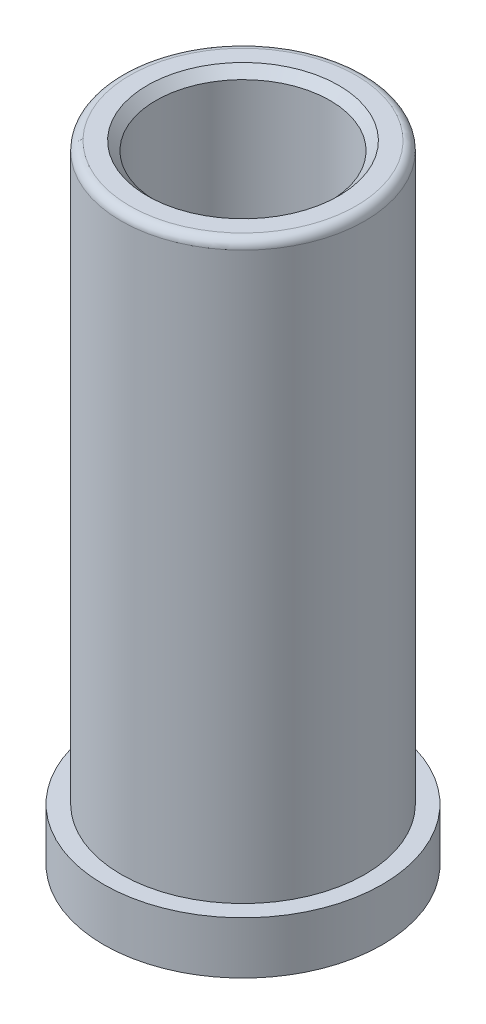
ISO-10303-21;
HEADER;
FILE_DESCRIPTION(('STEP AP214'),'2;1');
FILE_NAME('part.step','',(''),(''),'','','');
FILE_SCHEMA(('AUTOMOTIVE_DESIGN { 1 0 10303 214 1 1 1 1 }'));
ENDSEC;
DATA;
#1=APPLICATION_CONTEXT('core data for automotive mechanical design processes');
#2=APPLICATION_PROTOCOL_DEFINITION('international standard','automotive_design',2000,#1);
#3=PRODUCT_CONTEXT('',#1,'mechanical');
#4=PRODUCT('Part','Part','',(#3));
#5=PRODUCT_RELATED_PRODUCT_CATEGORY('part','',(#4));
#6=PRODUCT_DEFINITION_FORMATION('','',#4);
#7=PRODUCT_DEFINITION_CONTEXT('part definition',#1,'design');
#8=PRODUCT_DEFINITION('design','',#6,#7);
#9=PRODUCT_DEFINITION_SHAPE('','',#8);
#10=(LENGTH_UNIT() NAMED_UNIT(*) SI_UNIT(.MILLI.,.METRE.));
#11=(NAMED_UNIT(*) PLANE_ANGLE_UNIT() SI_UNIT($,.RADIAN.));
#12=(NAMED_UNIT(*) SI_UNIT($,.STERADIAN.) SOLID_ANGLE_UNIT());
#13=UNCERTAINTY_MEASURE_WITH_UNIT(LENGTH_MEASURE(1.E-05),#10,'distance_accuracy_value','');
#14=(GEOMETRIC_REPRESENTATION_CONTEXT(3) GLOBAL_UNCERTAINTY_ASSIGNED_CONTEXT((#13)) GLOBAL_UNIT_ASSIGNED_CONTEXT((#10,
#11,#12)) REPRESENTATION_CONTEXT('',''));
#15=CARTESIAN_POINT('',(0.,0.,0.));
#16=DIRECTION('',(0.,0.,1.));
#17=DIRECTION('',(1.,0.,0.));
#18=AXIS2_PLACEMENT_3D('',#15,#16,#17);
#19=CARTESIAN_POINT('',(0.,0.,0.));
#20=DIRECTION('',(0.,-1.,0.));
#21=DIRECTION('',(0.,0.,-1.));
#22=AXIS2_PLACEMENT_3D('',#19,#20,#21);
#23=CYLINDRICAL_SURFACE('',#22,7.);
#24=CARTESIAN_POINT('',(0.,32.5,0.));
#25=DIRECTION('',(0.,-1.,0.));
#26=DIRECTION('',(0.,0.,-1.));
#27=AXIS2_PLACEMENT_3D('',#24,#25,#26);
#28=CIRCLE('',#27,7.);
#29=CARTESIAN_POINT('',(0.,32.5,-7.));
#30=VERTEX_POINT('',#29);
#31=EDGE_CURVE('E21',#30,#30,#28,.T.);
#32=ORIENTED_EDGE('',*,*,#31,.T.);
#33=EDGE_LOOP('',(#32));
#34=FACE_BOUND('',#33,.T.);
#35=CARTESIAN_POINT('',(0.,0.,0.));
#36=DIRECTION('',(0.,-1.,0.));
#37=DIRECTION('',(0.,0.,-1.));
#38=AXIS2_PLACEMENT_3D('',#35,#36,#37);
#39=CIRCLE('',#38,7.);
#40=CARTESIAN_POINT('',(0.,0.,-7.));
#41=VERTEX_POINT('',#40);
#42=EDGE_CURVE('E49',#41,#41,#39,.T.);
#43=ORIENTED_EDGE('',*,*,#42,.F.);
#44=EDGE_LOOP('',(#43));
#45=FACE_BOUND('',#44,.T.);
#46=ADVANCED_FACE('F14',(#34,#45),#23,.T.);
#47=CARTESIAN_POINT('',(-7.,33.,0.));
#48=DIRECTION('',(0.,-1.,0.));
#49=DIRECTION('',(0.,0.,-1.));
#50=AXIS2_PLACEMENT_3D('',#47,#48,#49);
#51=PLANE('',#50);
#52=CARTESIAN_POINT('',(0.,33.,0.));
#53=DIRECTION('',(0.,-1.,0.));
#54=DIRECTION('',(0.,0.,-1.));
#55=AXIS2_PLACEMENT_3D('',#52,#53,#54);
#56=CIRCLE('',#55,6.5);
#57=CARTESIAN_POINT('',(0.,33.,-6.5));
#58=VERTEX_POINT('',#57);
#59=EDGE_CURVE('E9',#58,#58,#56,.F.);
#60=ORIENTED_EDGE('',*,*,#59,.T.);
#61=EDGE_LOOP('',(#60));
#62=FACE_BOUND('',#61,.T.);
#63=CARTESIAN_POINT('',(0.,33.,0.));
#64=DIRECTION('',(0.,-1.,0.));
#65=DIRECTION('',(0.,0.,-1.));
#66=AXIS2_PLACEMENT_3D('',#63,#64,#65);
#67=CIRCLE('',#66,5.5);
#68=CARTESIAN_POINT('',(0.,33.,-5.5));
#69=VERTEX_POINT('',#68);
#70=EDGE_CURVE('E37',#69,#69,#67,.T.);
#71=ORIENTED_EDGE('',*,*,#70,.T.);
#72=EDGE_LOOP('',(#71));
#73=FACE_BOUND('',#72,.T.);
#74=ADVANCED_FACE('F56',(#62,#73),#51,.F.);
#75=CARTESIAN_POINT('',(0.,0.,0.));
#76=DIRECTION('',(0.,-1.,0.));
#77=DIRECTION('',(0.,0.,-1.));
#78=AXIS2_PLACEMENT_3D('',#75,#76,#77);
#79=CYLINDRICAL_SURFACE('',#78,5.);
#80=CARTESIAN_POINT('',(0.,32.5,0.));
#81=DIRECTION('',(0.,-1.,0.));
#82=DIRECTION('',(0.,0.,-1.));
#83=AXIS2_PLACEMENT_3D('',#80,#81,#82);
#84=CIRCLE('',#83,5.);
#85=CARTESIAN_POINT('',(0.,32.5,-5.));
#86=VERTEX_POINT('',#85);
#87=EDGE_CURVE('E34',#86,#86,#84,.F.);
#88=ORIENTED_EDGE('',*,*,#87,.T.);
#89=EDGE_LOOP('',(#88));
#90=FACE_BOUND('',#89,.T.);
#91=CARTESIAN_POINT('',(0.,-3.,0.));
#92=DIRECTION('',(0.,-1.,0.));
#93=DIRECTION('',(0.,0.,-1.));
#94=AXIS2_PLACEMENT_3D('',#91,#92,#93);
#95=CIRCLE('',#94,5.);
#96=CARTESIAN_POINT('',(0.,-3.,-5.));
#97=VERTEX_POINT('',#96);
#98=EDGE_CURVE('E40',#97,#97,#95,.T.);
#99=ORIENTED_EDGE('',*,*,#98,.T.);
#100=EDGE_LOOP('',(#99));
#101=FACE_BOUND('',#100,.T.);
#102=ADVANCED_FACE('F63',(#90,#101),#79,.F.);
#103=CARTESIAN_POINT('',(0.,-3.15,0.));
#104=DIRECTION('',(0.,-1.,0.));
#105=DIRECTION('',(0.,0.,-1.));
#106=AXIS2_PLACEMENT_3D('',#103,#104,#105);
#107=CONICAL_SURFACE('',#106,5.1,0.588002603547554);
#108=CARTESIAN_POINT('',(0.,-3.36,0.));
#109=DIRECTION('',(0.,1.,0.));
#110=DIRECTION('',(0.,0.,1.));
#111=AXIS2_PLACEMENT_3D('',#108,#109,#110);
#112=CIRCLE('',#111,5.24);
#113=CARTESIAN_POINT('',(0.,-3.36,5.24));
#114=VERTEX_POINT('',#113);
#115=EDGE_CURVE('E25',#114,#114,#112,.F.);
#116=ORIENTED_EDGE('',*,*,#115,.T.);
#117=EDGE_LOOP('',(#116));
#118=FACE_BOUND('',#117,.T.);
#119=ORIENTED_EDGE('',*,*,#98,.F.);
#120=EDGE_LOOP('',(#119));
#121=FACE_BOUND('',#120,.T.);
#122=ADVANCED_FACE('F82',(#118,#121),#107,.F.);
#123=CARTESIAN_POINT('',(-5.1,-3.,0.));
#124=DIRECTION('',(0.,1.,0.));
#125=DIRECTION('',(0.,0.,1.));
#126=AXIS2_PLACEMENT_3D('',#123,#124,#125);
#127=PLANE('',#126);
#128=CARTESIAN_POINT('',(0.,-3.,0.));
#129=DIRECTION('',(0.,1.,0.));
#130=DIRECTION('',(0.,0.,1.));
#131=AXIS2_PLACEMENT_3D('',#128,#129,#130);
#132=CIRCLE('',#131,5.6);
#133=CARTESIAN_POINT('',(0.,-3.,5.6));
#134=VERTEX_POINT('',#133);
#135=EDGE_CURVE('E29',#134,#134,#132,.T.);
#136=ORIENTED_EDGE('',*,*,#135,.T.);
#137=EDGE_LOOP('',(#136));
#138=FACE_BOUND('',#137,.T.);
#139=CARTESIAN_POINT('',(0.,-3.,0.));
#140=DIRECTION('',(0.,-1.,0.));
#141=DIRECTION('',(0.,0.,-1.));
#142=AXIS2_PLACEMENT_3D('',#139,#140,#141);
#143=CIRCLE('',#142,8.);
#144=CARTESIAN_POINT('',(0.,-3.,-8.));
#145=VERTEX_POINT('',#144);
#146=EDGE_CURVE('E43',#145,#145,#143,.T.);
#147=ORIENTED_EDGE('',*,*,#146,.T.);
#148=EDGE_LOOP('',(#147));
#149=FACE_BOUND('',#148,.T.);
#150=ADVANCED_FACE('F85',(#138,#149),#127,.F.);
#151=CARTESIAN_POINT('',(0.,0.,0.));
#152=DIRECTION('',(0.,-1.,0.));
#153=DIRECTION('',(0.,0.,-1.));
#154=AXIS2_PLACEMENT_3D('',#151,#152,#153);
#155=CYLINDRICAL_SURFACE('',#154,8.);
#156=ORIENTED_EDGE('',*,*,#146,.F.);
#157=EDGE_LOOP('',(#156));
#158=FACE_BOUND('',#157,.T.);
#159=CARTESIAN_POINT('',(0.,0.,0.));
#160=DIRECTION('',(0.,-1.,0.));
#161=DIRECTION('',(0.,0.,-1.));
#162=AXIS2_PLACEMENT_3D('',#159,#160,#161);
#163=CIRCLE('',#162,8.);
#164=CARTESIAN_POINT('',(0.,0.,-8.));
#165=VERTEX_POINT('',#164);
#166=EDGE_CURVE('E46',#165,#165,#163,.T.);
#167=ORIENTED_EDGE('',*,*,#166,.T.);
#168=EDGE_LOOP('',(#167));
#169=FACE_BOUND('',#168,.T.);
#170=ADVANCED_FACE('F97',(#158,#169),#155,.T.);
#171=CARTESIAN_POINT('',(-8.,0.,0.));
#172=DIRECTION('',(0.,-1.,0.));
#173=DIRECTION('',(0.,0.,-1.));
#174=AXIS2_PLACEMENT_3D('',#171,#172,#173);
#175=PLANE('',#174);
#176=ORIENTED_EDGE('',*,*,#166,.F.);
#177=EDGE_LOOP('',(#176));
#178=FACE_BOUND('',#177,.T.);
#179=ORIENTED_EDGE('',*,*,#42,.T.);
#180=EDGE_LOOP('',(#179));
#181=FACE_BOUND('',#180,.T.);
#182=ADVANCED_FACE('F53',(#178,#181),#175,.F.);
#183=CARTESIAN_POINT('',(0.,33.,0.));
#184=DIRECTION('',(0.,1.,0.));
#185=DIRECTION('',(0.,0.,1.));
#186=AXIS2_PLACEMENT_3D('',#183,#184,#185);
#187=CONICAL_SURFACE('',#186,5.5,0.785398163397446);
#188=ORIENTED_EDGE('',*,*,#87,.F.);
#189=EDGE_LOOP('',(#188));
#190=FACE_BOUND('',#189,.T.);
#191=ORIENTED_EDGE('',*,*,#70,.F.);
#192=EDGE_LOOP('',(#191));
#193=FACE_BOUND('',#192,.T.);
#194=ADVANCED_FACE('F67',(#190,#193),#187,.F.);
#195=CARTESIAN_POINT('',(0.,-3.5,0.));
#196=DIRECTION('',(0.,1.,0.));
#197=DIRECTION('',(0.,0.,1.));
#198=AXIS2_PLACEMENT_3D('',#195,#196,#197);
#199=CONICAL_SURFACE('',#198,5.1,0.785398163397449);
#200=ORIENTED_EDGE('',*,*,#135,.F.);
#201=EDGE_LOOP('',(#200));
#202=FACE_BOUND('',#201,.T.);
#203=ORIENTED_EDGE('',*,*,#115,.F.);
#204=EDGE_LOOP('',(#203));
#205=FACE_BOUND('',#204,.T.);
#206=ADVANCED_FACE('F69',(#202,#205),#199,.T.);
#207=CARTESIAN_POINT('',(0.,32.5,0.));
#208=DIRECTION('',(0.,-1.,0.));
#209=DIRECTION('',(0.,0.,-1.));
#210=AXIS2_PLACEMENT_3D('',#207,#208,#209);
#211=TOROIDAL_SURFACE('',#210,6.5,0.5);
#212=ORIENTED_EDGE('',*,*,#59,.F.);
#213=EDGE_LOOP('',(#212));
#214=FACE_BOUND('',#213,.T.);
#215=ORIENTED_EDGE('',*,*,#31,.F.);
#216=EDGE_LOOP('',(#215));
#217=FACE_BOUND('',#216,.T.);
#218=ADVANCED_FACE('F16',(#214,#217),#211,.T.);
#219=CLOSED_SHELL('',(#46,#74,#102,#122,#150,#170,#182,#194,#206,#218));
#220=MANIFOLD_SOLID_BREP('B1',#219);
#221=ADVANCED_BREP_SHAPE_REPRESENTATION('',(#18,#220),#14);
#222=SHAPE_DEFINITION_REPRESENTATION(#9,#221);
ENDSEC;
END-ISO-10303-21;
